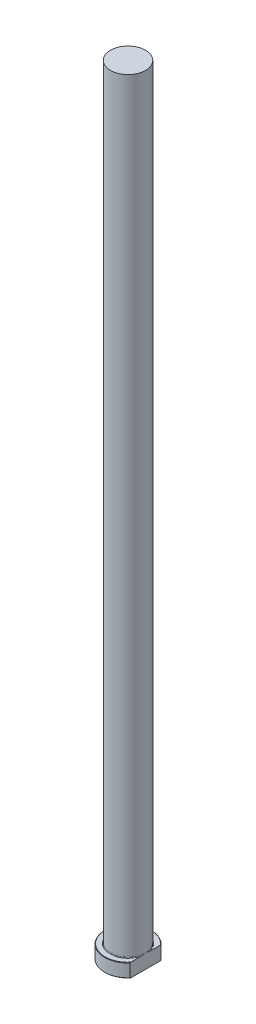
from build123d import *
from build123d.topology import SkipClean

# Parameters (mm, degrees)
CHAMFER1_SIZE = 0.2
FILLET1_R     = 0.3
KEY_DEPTH     = 401.359838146


with BuildPart() as part:
    # Sketch1 → Revolve1 (revolve)
    with BuildSketch(Plane.XY, mode=Mode.PRIVATE) as revolve1_sk:
        Polygon((0, 0), (-12, 0), (-12, 7), (-9, 7), (-9, 400), (0, 400), align=None)
    revolve(revolve1_sk.sketch.rotate(Axis((0, 259.958771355, 0), (0, -1, 0)), 270), axis=Axis((0, 259.958771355, 0), (0, -1, 0)))

    # Chamfer1
    chamfer1_edges = [part.edges().sort_by_distance(p)[0] for p in [
        (0, 7, -12),
        (0, 0, -12),
    ]]
    chamfer(chamfer1_edges, length=CHAMFER1_SIZE)

    # Fillet1
    fillet1_edges = [part.edges().sort_by_distance(p)[0] for p in [
        (0, 7, -9),
    ]]
    fillet(fillet1_edges, radius=FILLET1_R)

    # Sketch2 → KEY (cut, through all)
    with SkipClean():  # the faces are left unmerged after this step: merging them gives an invalid solid
        with BuildSketch(Plane(origin=(0, 0, 0), x_dir=(1, 0, 0), z_dir=(0, 1, 0))):
            with BuildLine():
                Line((9, 7.937253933), (9, -7.937253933))
                ThreePointArc((9, -7.937253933), (12, 0), (9, 7.937253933))
            make_face()
        extrude(amount=KEY_DEPTH, mode=Mode.SUBTRACT)


solid = part.part
